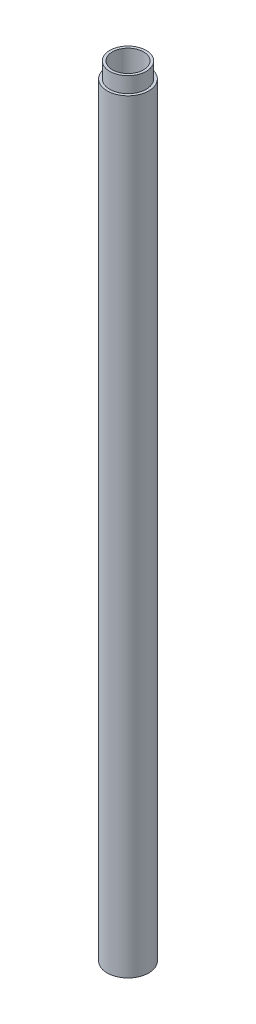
ISO-10303-21;
HEADER;
FILE_DESCRIPTION(('STEP AP214'),'2;1');
FILE_NAME('part.step','',(''),(''),'','','');
FILE_SCHEMA(('AUTOMOTIVE_DESIGN { 1 0 10303 214 1 1 1 1 }'));
ENDSEC;
DATA;
#1=APPLICATION_CONTEXT('core data for automotive mechanical design processes');
#2=APPLICATION_PROTOCOL_DEFINITION('international standard','automotive_design',2000,#1);
#3=PRODUCT_CONTEXT('',#1,'mechanical');
#4=PRODUCT('Part','Part','',(#3));
#5=PRODUCT_RELATED_PRODUCT_CATEGORY('part','',(#4));
#6=PRODUCT_DEFINITION_FORMATION('','',#4);
#7=PRODUCT_DEFINITION_CONTEXT('part definition',#1,'design');
#8=PRODUCT_DEFINITION('design','',#6,#7);
#9=PRODUCT_DEFINITION_SHAPE('','',#8);
#10=(LENGTH_UNIT() NAMED_UNIT(*) SI_UNIT(.MILLI.,.METRE.));
#11=(NAMED_UNIT(*) PLANE_ANGLE_UNIT() SI_UNIT($,.RADIAN.));
#12=(NAMED_UNIT(*) SI_UNIT($,.STERADIAN.) SOLID_ANGLE_UNIT());
#13=UNCERTAINTY_MEASURE_WITH_UNIT(LENGTH_MEASURE(1.E-05),#10,'distance_accuracy_value','');
#14=(GEOMETRIC_REPRESENTATION_CONTEXT(3) GLOBAL_UNCERTAINTY_ASSIGNED_CONTEXT((#13)) GLOBAL_UNIT_ASSIGNED_CONTEXT((#10,
#11,#12)) REPRESENTATION_CONTEXT('',''));
#15=CARTESIAN_POINT('',(0.,0.,0.));
#16=DIRECTION('',(0.,0.,1.));
#17=DIRECTION('',(1.,0.,0.));
#18=AXIS2_PLACEMENT_3D('',#15,#16,#17);
#19=CARTESIAN_POINT('',(0.,150.,0.));
#20=DIRECTION('',(0.,-1.,0.));
#21=DIRECTION('',(0.,0.,-1.));
#22=AXIS2_PLACEMENT_3D('',#19,#20,#21);
#23=CYLINDRICAL_SURFACE('',#22,4.);
#24=CARTESIAN_POINT('',(0.,0.,0.));
#25=DIRECTION('',(0.,1.,0.));
#26=DIRECTION('',(0.,0.,1.));
#27=AXIS2_PLACEMENT_3D('',#24,#25,#26);
#28=CIRCLE('',#27,4.);
#29=CARTESIAN_POINT('',(0.,0.,4.));
#30=VERTEX_POINT('',#29);
#31=EDGE_CURVE('E11',#30,#30,#28,.T.);
#32=ORIENTED_EDGE('',*,*,#31,.T.);
#33=EDGE_LOOP('',(#32));
#34=FACE_BOUND('',#33,.T.);
#35=CARTESIAN_POINT('',(0.,147.,0.));
#36=DIRECTION('',(0.,1.,0.));
#37=DIRECTION('',(0.,0.,1.));
#38=AXIS2_PLACEMENT_3D('',#35,#36,#37);
#39=CIRCLE('',#38,4.);
#40=CARTESIAN_POINT('',(0.,147.,4.));
#41=VERTEX_POINT('',#40);
#42=EDGE_CURVE('E35',#41,#41,#39,.T.);
#43=ORIENTED_EDGE('',*,*,#42,.F.);
#44=EDGE_LOOP('',(#43));
#45=FACE_BOUND('',#44,.T.);
#46=ADVANCED_FACE('F32',(#34,#45),#23,.T.);
#47=CARTESIAN_POINT('',(0.,150.,0.));
#48=DIRECTION('',(0.,1.,0.));
#49=DIRECTION('',(0.,0.,1.));
#50=AXIS2_PLACEMENT_3D('',#47,#48,#49);
#51=PLANE('',#50);
#52=CARTESIAN_POINT('',(0.,150.,0.));
#53=DIRECTION('',(0.,1.,0.));
#54=DIRECTION('',(0.,0.,1.));
#55=AXIS2_PLACEMENT_3D('',#52,#53,#54);
#56=CIRCLE('',#55,3.);
#57=CARTESIAN_POINT('',(0.,150.,3.));
#58=VERTEX_POINT('',#57);
#59=EDGE_CURVE('E43',#58,#58,#56,.T.);
#60=ORIENTED_EDGE('',*,*,#59,.F.);
#61=EDGE_LOOP('',(#60));
#62=FACE_BOUND('',#61,.T.);
#63=CARTESIAN_POINT('',(0.,150.,0.));
#64=DIRECTION('',(0.,1.,0.));
#65=DIRECTION('',(0.,0.,1.));
#66=AXIS2_PLACEMENT_3D('',#63,#64,#65);
#67=CIRCLE('',#66,3.5);
#68=CARTESIAN_POINT('',(0.,150.,3.5));
#69=VERTEX_POINT('',#68);
#70=EDGE_CURVE('E48',#69,#69,#67,.T.);
#71=ORIENTED_EDGE('',*,*,#70,.T.);
#72=EDGE_LOOP('',(#71));
#73=FACE_BOUND('',#72,.T.);
#74=ADVANCED_FACE('F61',(#62,#73),#51,.T.);
#75=CARTESIAN_POINT('',(0.,0.,0.));
#76=DIRECTION('',(0.,1.,0.));
#77=DIRECTION('',(0.,0.,1.));
#78=AXIS2_PLACEMENT_3D('',#75,#76,#77);
#79=PLANE('',#78);
#80=CARTESIAN_POINT('',(0.,0.,0.));
#81=DIRECTION('',(0.,1.,0.));
#82=DIRECTION('',(0.,0.,1.));
#83=AXIS2_PLACEMENT_3D('',#80,#81,#82);
#84=CIRCLE('',#83,3.);
#85=CARTESIAN_POINT('',(0.,0.,3.));
#86=VERTEX_POINT('',#85);
#87=EDGE_CURVE('E39',#86,#86,#84,.T.);
#88=ORIENTED_EDGE('',*,*,#87,.T.);
#89=EDGE_LOOP('',(#88));
#90=FACE_BOUND('',#89,.T.);
#91=ORIENTED_EDGE('',*,*,#31,.F.);
#92=EDGE_LOOP('',(#91));
#93=FACE_BOUND('',#92,.T.);
#94=ADVANCED_FACE('F65',(#90,#93),#79,.F.);
#95=CARTESIAN_POINT('',(0.,0.,0.));
#96=DIRECTION('',(0.,1.,0.));
#97=DIRECTION('',(0.,0.,1.));
#98=AXIS2_PLACEMENT_3D('',#95,#96,#97);
#99=CYLINDRICAL_SURFACE('',#98,3.);
#100=ORIENTED_EDGE('',*,*,#87,.F.);
#101=EDGE_LOOP('',(#100));
#102=FACE_BOUND('',#101,.T.);
#103=ORIENTED_EDGE('',*,*,#59,.T.);
#104=EDGE_LOOP('',(#103));
#105=FACE_BOUND('',#104,.T.);
#106=ADVANCED_FACE('F71',(#102,#105),#99,.F.);
#107=CARTESIAN_POINT('',(0.,147.,0.));
#108=DIRECTION('',(0.,1.,0.));
#109=DIRECTION('',(0.,0.,1.));
#110=AXIS2_PLACEMENT_3D('',#107,#108,#109);
#111=PLANE('',#110);
#112=CARTESIAN_POINT('',(0.,147.,0.));
#113=DIRECTION('',(0.,1.,0.));
#114=DIRECTION('',(0.,0.,1.));
#115=AXIS2_PLACEMENT_3D('',#112,#113,#114);
#116=CIRCLE('',#115,3.5);
#117=CARTESIAN_POINT('',(0.,147.,3.5));
#118=VERTEX_POINT('',#117);
#119=EDGE_CURVE('E51',#118,#118,#116,.T.);
#120=ORIENTED_EDGE('',*,*,#119,.F.);
#121=EDGE_LOOP('',(#120));
#122=FACE_BOUND('',#121,.T.);
#123=ORIENTED_EDGE('',*,*,#42,.T.);
#124=EDGE_LOOP('',(#123));
#125=FACE_BOUND('',#124,.T.);
#126=ADVANCED_FACE('F58',(#122,#125),#111,.T.);
#127=CARTESIAN_POINT('',(0.,147.,0.));
#128=DIRECTION('',(0.,1.,0.));
#129=DIRECTION('',(0.,0.,1.));
#130=AXIS2_PLACEMENT_3D('',#127,#128,#129);
#131=CYLINDRICAL_SURFACE('',#130,3.5);
#132=ORIENTED_EDGE('',*,*,#119,.T.);
#133=EDGE_LOOP('',(#132));
#134=FACE_BOUND('',#133,.T.);
#135=ORIENTED_EDGE('',*,*,#70,.F.);
#136=EDGE_LOOP('',(#135));
#137=FACE_BOUND('',#136,.T.);
#138=ADVANCED_FACE('F81',(#134,#137),#131,.T.);
#139=CLOSED_SHELL('',(#46,#74,#94,#106,#126,#138));
#140=MANIFOLD_SOLID_BREP('B2',#139);
#141=ADVANCED_BREP_SHAPE_REPRESENTATION('',(#18,#140),#14);
#142=SHAPE_DEFINITION_REPRESENTATION(#9,#141);
ENDSEC;
END-ISO-10303-21;
